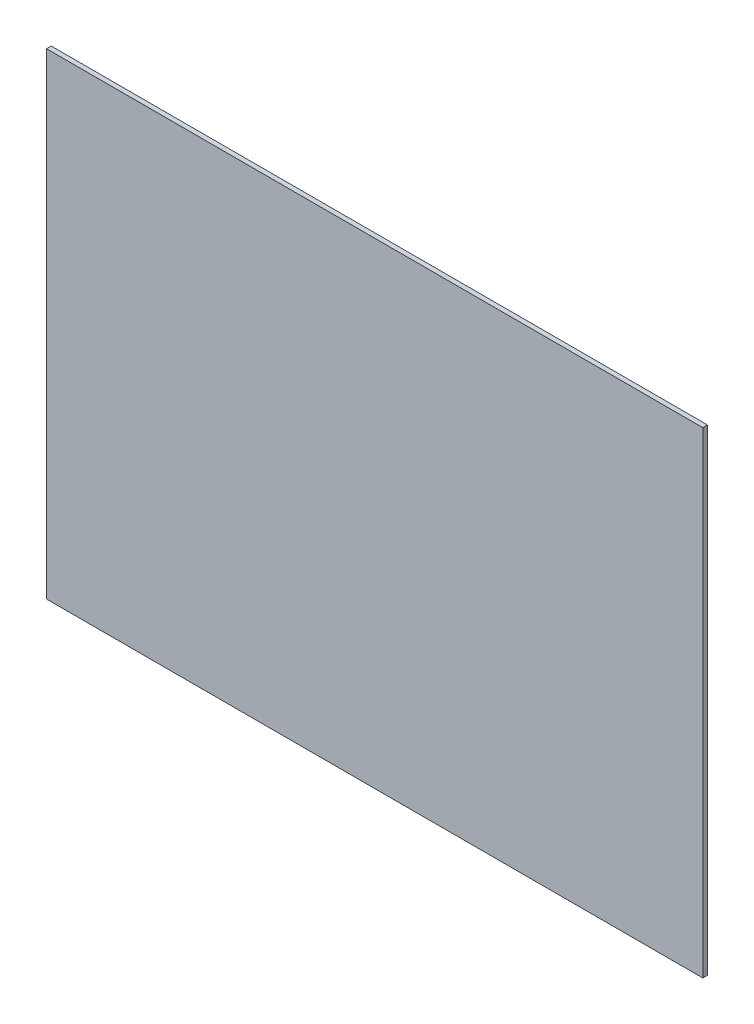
ISO-10303-21;
HEADER;
FILE_DESCRIPTION(('STEP AP214'),'2;1');
FILE_NAME('part.step','',(''),(''),'','','');
FILE_SCHEMA(('AUTOMOTIVE_DESIGN { 1 0 10303 214 1 1 1 1 }'));
ENDSEC;
DATA;
#1=APPLICATION_CONTEXT('core data for automotive mechanical design processes');
#2=APPLICATION_PROTOCOL_DEFINITION('international standard','automotive_design',2000,#1);
#3=PRODUCT_CONTEXT('',#1,'mechanical');
#4=PRODUCT('Part','Part','',(#3));
#5=PRODUCT_RELATED_PRODUCT_CATEGORY('part','',(#4));
#6=PRODUCT_DEFINITION_FORMATION('','',#4);
#7=PRODUCT_DEFINITION_CONTEXT('part definition',#1,'design');
#8=PRODUCT_DEFINITION('design','',#6,#7);
#9=PRODUCT_DEFINITION_SHAPE('','',#8);
#10=(LENGTH_UNIT() NAMED_UNIT(*) SI_UNIT(.MILLI.,.METRE.));
#11=(NAMED_UNIT(*) PLANE_ANGLE_UNIT() SI_UNIT($,.RADIAN.));
#12=(NAMED_UNIT(*) SI_UNIT($,.STERADIAN.) SOLID_ANGLE_UNIT());
#13=UNCERTAINTY_MEASURE_WITH_UNIT(LENGTH_MEASURE(1.E-05),#10,'distance_accuracy_value','');
#14=(GEOMETRIC_REPRESENTATION_CONTEXT(3) GLOBAL_UNCERTAINTY_ASSIGNED_CONTEXT((#13)) GLOBAL_UNIT_ASSIGNED_CONTEXT((#10,
#11,#12)) REPRESENTATION_CONTEXT('',''));
#15=CARTESIAN_POINT('',(0.,0.,0.));
#16=DIRECTION('',(0.,0.,1.));
#17=DIRECTION('',(1.,0.,0.));
#18=AXIS2_PLACEMENT_3D('',#15,#16,#17);
#19=CARTESIAN_POINT('',(0.,122.,1.2));
#20=DIRECTION('',(0.,0.,-1.));
#21=DIRECTION('',(-1.,0.,0.));
#22=AXIS2_PLACEMENT_3D('',#19,#20,#21);
#23=PLANE('',#22);
#24=DIRECTION('',(1.,0.,0.));
#25=VECTOR('',#24,1.);
#26=CARTESIAN_POINT('',(0.,0.,1.2));
#27=LINE('',#26,#25);
#28=CARTESIAN_POINT('',(0.,0.,1.2));
#29=VERTEX_POINT('',#28);
#30=CARTESIAN_POINT('',(168.,0.,1.2));
#31=VERTEX_POINT('',#30);
#32=EDGE_CURVE('E97',#29,#31,#27,.T.);
#33=ORIENTED_EDGE('',*,*,#32,.T.);
#34=DIRECTION('',(0.,-1.,0.));
#35=VECTOR('',#34,1.);
#36=CARTESIAN_POINT('',(168.,122.,1.2));
#37=LINE('',#36,#35);
#38=CARTESIAN_POINT('',(168.,122.,1.2));
#39=VERTEX_POINT('',#38);
#40=EDGE_CURVE('E11',#39,#31,#37,.T.);
#41=ORIENTED_EDGE('',*,*,#40,.F.);
#42=DIRECTION('',(1.,0.,0.));
#43=VECTOR('',#42,1.);
#44=CARTESIAN_POINT('',(0.,122.,1.2));
#45=LINE('',#44,#43);
#46=CARTESIAN_POINT('',(0.,122.,1.2));
#47=VERTEX_POINT('',#46);
#48=EDGE_CURVE('E74',#47,#39,#45,.T.);
#49=ORIENTED_EDGE('',*,*,#48,.F.);
#50=DIRECTION('',(0.,-1.,0.));
#51=VECTOR('',#50,1.);
#52=CARTESIAN_POINT('',(0.,122.,1.2));
#53=LINE('',#52,#51);
#54=EDGE_CURVE('E50',#47,#29,#53,.T.);
#55=ORIENTED_EDGE('',*,*,#54,.T.);
#56=EDGE_LOOP('',(#33,#41,#49,#55));
#57=FACE_BOUND('',#56,.T.);
#58=ADVANCED_FACE('F34',(#57),#23,.F.);
#59=CARTESIAN_POINT('',(168.,122.,0.));
#60=DIRECTION('',(1.,0.,0.));
#61=DIRECTION('',(0.,0.,-1.));
#62=AXIS2_PLACEMENT_3D('',#59,#60,#61);
#63=PLANE('',#62);
#64=DIRECTION('',(0.,0.,1.));
#65=VECTOR('',#64,1.);
#66=CARTESIAN_POINT('',(168.,0.,0.));
#67=LINE('',#66,#65);
#68=CARTESIAN_POINT('',(168.,0.,0.));
#69=VERTEX_POINT('',#68);
#70=EDGE_CURVE('E83',#69,#31,#67,.T.);
#71=ORIENTED_EDGE('',*,*,#70,.F.);
#72=DIRECTION('',(0.,-1.,0.));
#73=VECTOR('',#72,1.);
#74=CARTESIAN_POINT('',(168.,122.,0.));
#75=LINE('',#74,#73);
#76=CARTESIAN_POINT('',(168.,122.,0.));
#77=VERTEX_POINT('',#76);
#78=EDGE_CURVE('E42',#77,#69,#75,.T.);
#79=ORIENTED_EDGE('',*,*,#78,.F.);
#80=DIRECTION('',(0.,0.,1.));
#81=VECTOR('',#80,1.);
#82=CARTESIAN_POINT('',(168.,122.,0.));
#83=LINE('',#82,#81);
#84=EDGE_CURVE('E81',#77,#39,#83,.T.);
#85=ORIENTED_EDGE('',*,*,#84,.T.);
#86=ORIENTED_EDGE('',*,*,#40,.T.);
#87=EDGE_LOOP('',(#71,#79,#85,#86));
#88=FACE_BOUND('',#87,.T.);
#89=ADVANCED_FACE('F80',(#88),#63,.T.);
#90=CARTESIAN_POINT('',(0.,122.,0.));
#91=DIRECTION('',(0.,0.,-1.));
#92=DIRECTION('',(-1.,0.,0.));
#93=AXIS2_PLACEMENT_3D('',#90,#91,#92);
#94=PLANE('',#93);
#95=DIRECTION('',(1.,0.,0.));
#96=VECTOR('',#95,1.);
#97=CARTESIAN_POINT('',(0.,0.,0.));
#98=LINE('',#97,#96);
#99=CARTESIAN_POINT('',(0.,0.,0.));
#100=VERTEX_POINT('',#99);
#101=EDGE_CURVE('E100',#100,#69,#98,.T.);
#102=ORIENTED_EDGE('',*,*,#101,.F.);
#103=DIRECTION('',(0.,-1.,0.));
#104=VECTOR('',#103,1.);
#105=CARTESIAN_POINT('',(0.,122.,0.));
#106=LINE('',#105,#104);
#107=CARTESIAN_POINT('',(0.,122.,0.));
#108=VERTEX_POINT('',#107);
#109=EDGE_CURVE('E63',#108,#100,#106,.T.);
#110=ORIENTED_EDGE('',*,*,#109,.F.);
#111=DIRECTION('',(1.,0.,0.));
#112=VECTOR('',#111,1.);
#113=CARTESIAN_POINT('',(0.,122.,0.));
#114=LINE('',#113,#112);
#115=EDGE_CURVE('E89',#108,#77,#114,.T.);
#116=ORIENTED_EDGE('',*,*,#115,.T.);
#117=ORIENTED_EDGE('',*,*,#78,.T.);
#118=EDGE_LOOP('',(#102,#110,#116,#117));
#119=FACE_BOUND('',#118,.T.);
#120=ADVANCED_FACE('F91',(#119),#94,.T.);
#121=CARTESIAN_POINT('',(0.,122.,1.2));
#122=DIRECTION('',(-1.,0.,0.));
#123=DIRECTION('',(0.,0.,1.));
#124=AXIS2_PLACEMENT_3D('',#121,#122,#123);
#125=PLANE('',#124);
#126=DIRECTION('',(0.,0.,-1.));
#127=VECTOR('',#126,1.);
#128=CARTESIAN_POINT('',(0.,0.,1.2));
#129=LINE('',#128,#127);
#130=EDGE_CURVE('E102',#29,#100,#129,.T.);
#131=ORIENTED_EDGE('',*,*,#130,.F.);
#132=ORIENTED_EDGE('',*,*,#54,.F.);
#133=DIRECTION('',(0.,0.,-1.));
#134=VECTOR('',#133,1.);
#135=CARTESIAN_POINT('',(0.,122.,1.2));
#136=LINE('',#135,#134);
#137=EDGE_CURVE('E92',#47,#108,#136,.T.);
#138=ORIENTED_EDGE('',*,*,#137,.T.);
#139=ORIENTED_EDGE('',*,*,#109,.T.);
#140=EDGE_LOOP('',(#131,#132,#138,#139));
#141=FACE_BOUND('',#140,.T.);
#142=ADVANCED_FACE('F108',(#141),#125,.T.);
#143=CARTESIAN_POINT('',(168.,122.,1.2));
#144=DIRECTION('',(0.,-1.,0.));
#145=DIRECTION('',(0.,0.,-1.));
#146=AXIS2_PLACEMENT_3D('',#143,#144,#145);
#147=PLANE('',#146);
#148=ORIENTED_EDGE('',*,*,#48,.T.);
#149=ORIENTED_EDGE('',*,*,#84,.F.);
#150=ORIENTED_EDGE('',*,*,#115,.F.);
#151=ORIENTED_EDGE('',*,*,#137,.F.);
#152=EDGE_LOOP('',(#148,#149,#150,#151));
#153=FACE_BOUND('',#152,.T.);
#154=ADVANCED_FACE('F88',(#153),#147,.F.);
#155=CARTESIAN_POINT('',(168.,0.,1.2));
#156=DIRECTION('',(0.,-1.,0.));
#157=DIRECTION('',(0.,0.,-1.));
#158=AXIS2_PLACEMENT_3D('',#155,#156,#157);
#159=PLANE('',#158);
#160=ORIENTED_EDGE('',*,*,#32,.F.);
#161=ORIENTED_EDGE('',*,*,#130,.T.);
#162=ORIENTED_EDGE('',*,*,#101,.T.);
#163=ORIENTED_EDGE('',*,*,#70,.T.);
#164=EDGE_LOOP('',(#160,#161,#162,#163));
#165=FACE_BOUND('',#164,.T.);
#166=ADVANCED_FACE('F107',(#165),#159,.T.);
#167=CLOSED_SHELL('',(#58,#89,#120,#142,#154,#166));
#168=MANIFOLD_SOLID_BREP('B2',#167);
#169=ADVANCED_BREP_SHAPE_REPRESENTATION('',(#18,#168),#14);
#170=SHAPE_DEFINITION_REPRESENTATION(#9,#169);
ENDSEC;
END-ISO-10303-21;
